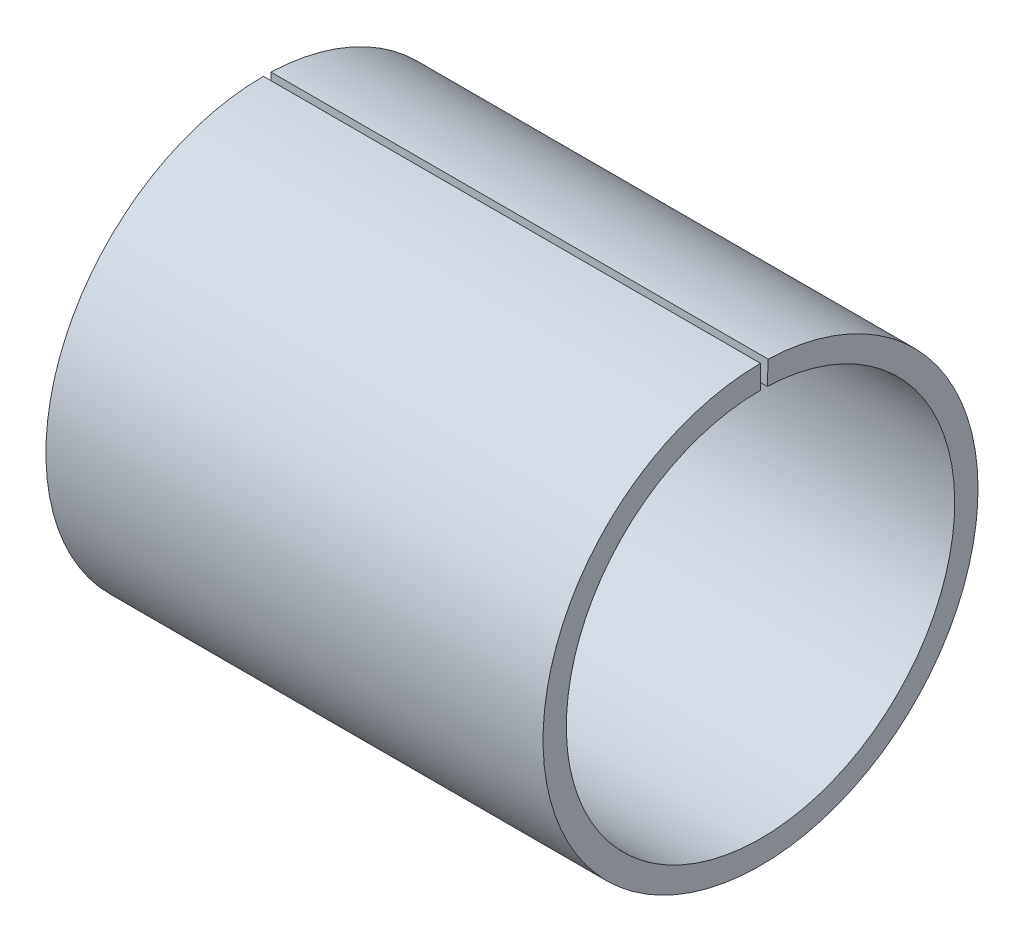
from build123d import *

# Parameters (mm, degrees)
ESQUISSE1_W           = 32
ESQUISSE1_H           = 1.5
BASE_R_VOLUTION_ANGLE = 358


with BuildPart() as part:
    # Esquisse1 → Base-R_volution (revolve)
    with BuildSketch(Plane.XY):
        with Locations((16, 13.25)):
            Rectangle(ESQUISSE1_W, ESQUISSE1_H)
    revolve(axis=Axis((0, 0, 0), (1, 0, 0)), revolution_arc=BASE_R_VOLUTION_ANGLE)


solid = part.part
